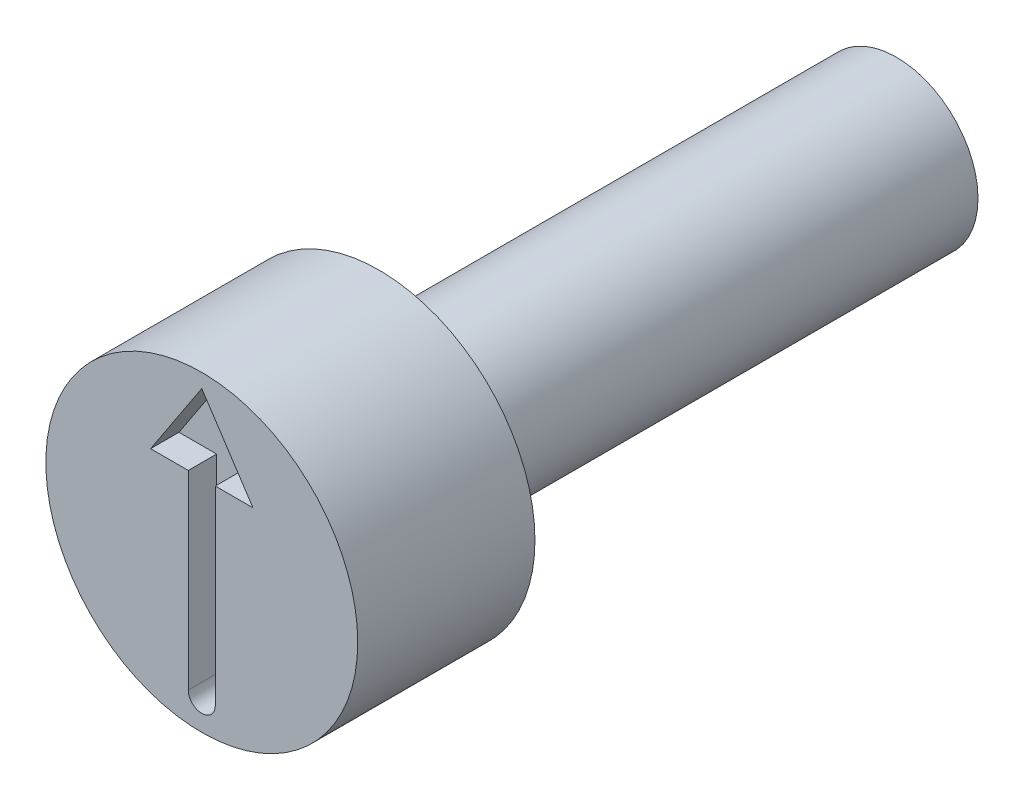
from build123d import *

# Parameters (mm, degrees)
CUT_EXTRUDE4_DEPTH = 0.4


with BuildPart() as part:
    # Sketch2 → Revolve1 (revolve)
    with BuildSketch(Plane(origin=(0, 0, 0), x_dir=(0, 0, -1), z_dir=(1, 0, 0)), mode=Mode.PRIVATE) as revolve1_sk:
        Polygon((0, 2.2), (0, 0), (9.8, 0), (9.8, 1.15), (2.5, 1.15), (2.5, 2.2), align=None)
    revolve(revolve1_sk.sketch.rotate(Axis((0, 0, -0.403888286), (0, 0, -1)), 90), axis=Axis((0, 0, -0.403888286), (0, 0, -1)))

    # Sketch3 → Cut-Extrude4 (cut)
    with BuildSketch(Plane.XY):
        with BuildLine():
            Line((0.190473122, 0.906351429), (0.190473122, -1.776161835))
            ThreePointArc((0.190473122, -1.776161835), (0, -1.966634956), (-0.190473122, -1.776161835))
            Line((-0.190473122, -1.776161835), (-0.190473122, 0.906351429))
            Line((-0.190473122, 0.906351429), (-0.721917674, 0.906351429))
            Line((-0.721917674, 0.906351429), (0, 2.002115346))
            Line((0, 2.002115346), (0.721917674, 0.906351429))
            Line((0.721917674, 0.906351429), (0.190473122, 0.906351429))
        make_face()
    extrude(amount=-CUT_EXTRUDE4_DEPTH, mode=Mode.SUBTRACT)


solid = part.part
